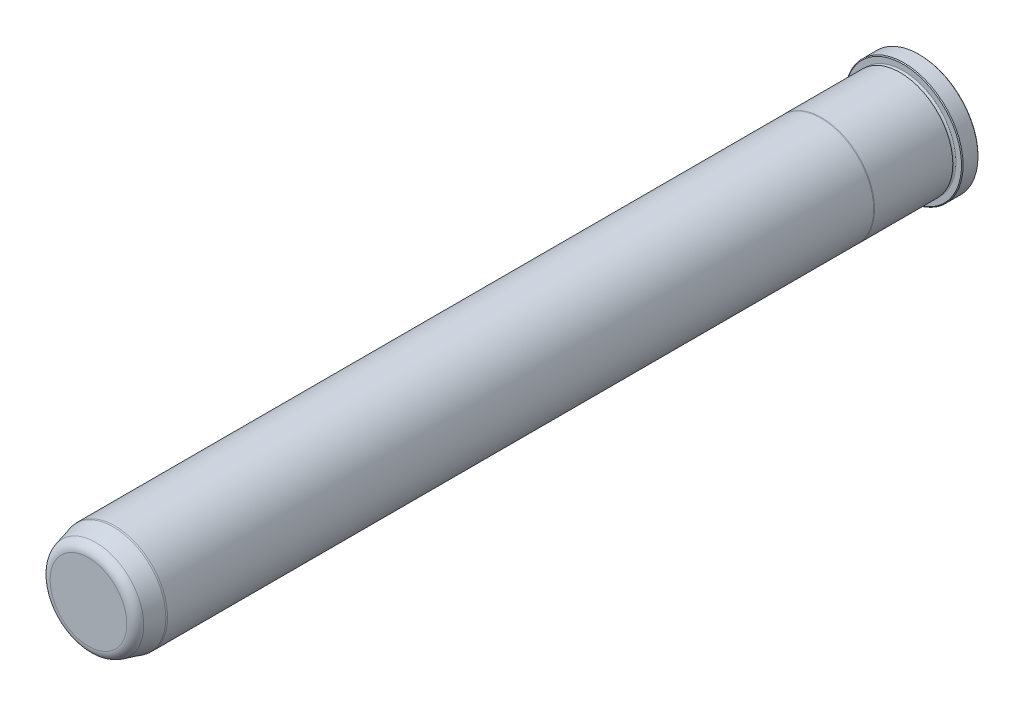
from build123d import *

# Parameters (mm, degrees)
FILLET6_R     = 4.7625
CHAMFER1_SIZE = 0.381


with BuildPart() as part:
    # Sketch1 → Revolve1 (revolve)
    with BuildSketch(Plane(origin=(0, 0, 0), x_dir=(0, 0, -1), z_dir=(1, 0, 0)), mode=Mode.PRIVATE) as revolve1_sk:
        with BuildLine():
            Line((0, 0), (0, 28.448))
            Line((0, 28.448), (-7.9248, 28.448))
            Line((-7.9248, 28.448), (-7.9248, 25.3873))
            ThreePointArc((-7.9248, 25.3873), (-8.6868, 24.6253), (-9.4488, 25.3873))
            Line((-9.4488, 25.3873), (-9.4488, 25.4127))
            Line((-9.4488, 25.4127), (-47.134763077, 25.4127))
            Line((-47.134763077, 25.4127), (-47.498, 25.3873))
            Line((-47.498, 25.3873), (-387.35, 25.3873))
            Line((-387.35, 25.3873), (-388.112, 25.320633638))
            Line((-388.112, 25.320633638), (-400.05, 22.121856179))
            Line((-400.05, 22.121856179), (-400.05, 0))
            Line((-400.05, 0), (0, 0))
        make_face()
    revolve(revolve1_sk.sketch.rotate(Axis((0, 0, 0), (0, 0, -1)), 90), axis=Axis((0, 0, 0), (0, 0, -1)))

    # Fillet6
    fillet6_edges = [part.edges().sort_by_distance(p)[0] for p in [
        (-22.121856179, 0, 400.05),
    ]]
    fillet(fillet6_edges, radius=FILLET6_R)

    # Chamfer1
    chamfer1_edges = [part.edges().sort_by_distance(p)[0] for p in [
        (-28.448, 0, 7.9248),
        (-28.448, 0, 0),
    ]]
    chamfer(chamfer1_edges, length=CHAMFER1_SIZE)


solid = part.part
